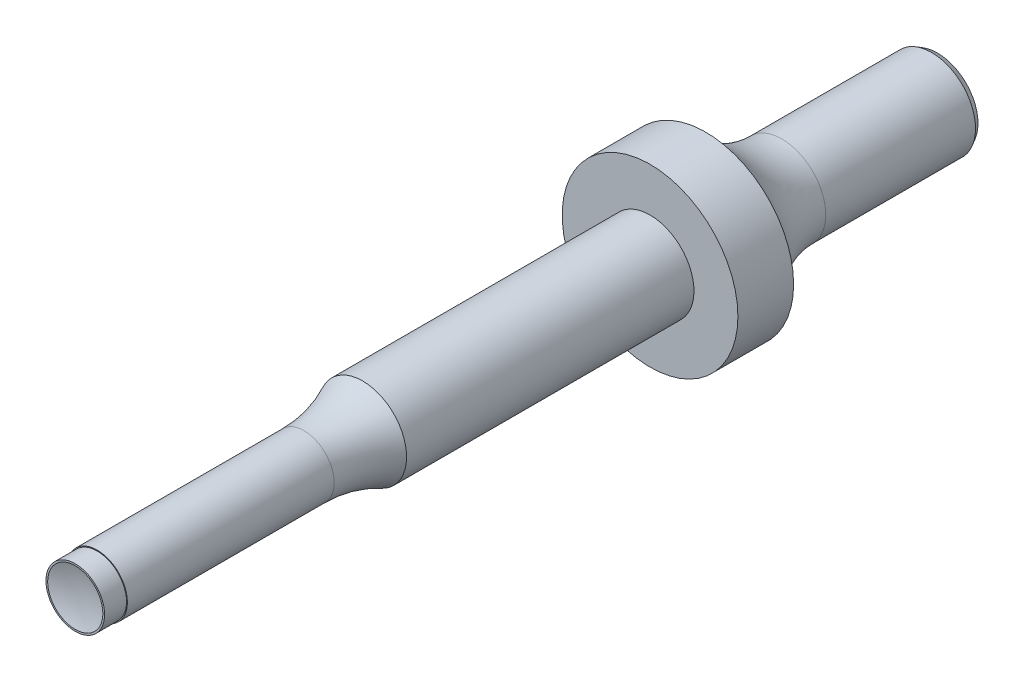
from build123d import *

# Parameters (mm, degrees)
SKETCH1_R           = 5.095
BOSS_EXTRUDE1_DEPTH = 100
SKETCH2_OUTSIDE_W   = 32.396
SKETCH2_OUTSIDE_H   = 32.396
SKETCH2_OUTSIDE_R   = 3.5
CUT_EXTRUDE1_DEPTH  = 33.333333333
SKETCH3_OUTSIDE_W   = 32.396
SKETCH3_OUTSIDE_H   = 32.396
SKETCH3_OUTSIDE_R   = 3.4
CUT_EXTRUDE2_DEPTH  = 2.5475
CHAMFER1_SIZE       = 0.679333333
CHAMFER1_SIZE2      = 0.392213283


with BuildPart() as part:
    # Sketch1 → Boss-Extrude1 (new body)
    with BuildSketch(Plane.XY):
        Circle(SKETCH1_R)
    extrude(amount=-BOSS_EXTRUDE1_DEPTH)

    # Sketch2 outside → Cut-Extrude1 (cut)
    with BuildSketch(Plane.XY):
        Rectangle(SKETCH2_OUTSIDE_W, SKETCH2_OUTSIDE_H)
        Circle(SKETCH2_OUTSIDE_R, mode=Mode.SUBTRACT)
    extrude(amount=-CUT_EXTRUDE1_DEPTH, mode=Mode.SUBTRACT)

    # Sketch3 outside → Cut-Extrude2 (cut)
    with BuildSketch(Plane.XY):
        Rectangle(SKETCH3_OUTSIDE_W, SKETCH3_OUTSIDE_H)
        Circle(SKETCH3_OUTSIDE_R, mode=Mode.SUBTRACT)
    extrude(amount=-CUT_EXTRUDE2_DEPTH, mode=Mode.SUBTRACT)

    # Sketch4 → Cut-Revolve1 (revolve, cut)
    with BuildSketch(Plane(origin=(0, 0, 0), x_dir=(0, 0, -1), z_dir=(1, 0, 0)), mode=Mode.PRIVATE) as cut_revolve1_sk:
        with BuildLine():
            Line((0, 0), (0, 3.2))
            ThreePointArc((0, 3.2), (0.385793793, 1.620627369), (0.515492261, 0))
            Line((0.515492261, 0), (0, 0))
        make_face()
    revolve(cut_revolve1_sk.sketch.rotate(Axis((0, 0, 0), (0, 0, -1)), 180), axis=Axis((0, 0, 0), (0, 0, -1)), mode=Mode.SUBTRACT)

    # Chamfer1
    chamfer1_edges = [part.edges().sort_by_distance(p)[0] for p in [
        (-5.095, 0, -100),
    ]]
    chamfer1_side = [part.faces().sort_by_distance(p)[0] for p in [
        (-5.095, 0, -66.666666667),
    ]]
    chamfer(chamfer1_edges, length=CHAMFER1_SIZE, length2=CHAMFER1_SIZE2, reference=chamfer1_side[0])

    # Sketch5 → Revolve1 (revolve)
    with BuildSketch(Plane(origin=(0, 0, 0), x_dir=(0, 0, -1), z_dir=(1, 0, 0)), mode=Mode.PRIVATE) as revolve1_sk:
        with BuildLine():
            Line((33.333333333, 0), (26.535162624, 0))
            Line((26.535162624, 0), (26.535162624, 3.5))
            ThreePointArc((26.535162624, 3.5), (30.026550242, 3.90409151), (33.333333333, 5.095))
            Line((33.333333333, 5.095), (33.333333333, 0))
        make_face()
    revolve(revolve1_sk.sketch.rotate(Axis((0, 0, -33.333333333), (0, 0, 1)), 270), axis=Axis((0, 0, -33.333333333), (0, 0, 1)))

    # Sketch6 → Revolve2 (revolve)
    with BuildSketch(Plane(origin=(0, 0, 0), x_dir=(0, 0, -1), z_dir=(1, 0, 0)), mode=Mode.PRIVATE) as revolve2_sk:
        with BuildLine():
            Line((66.666666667, 0), (81.951666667, 0))
            Line((81.951666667, 0), (81.951666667, 5.095))
            ThreePointArc((81.951666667, 5.095), (76.856666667, 6.460201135), (73.126867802, 10.19))
            Line((73.126867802, 10.19), (66.666666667, 10.19))
            Line((66.666666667, 10.19), (66.666666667, 0))
        make_face()
    revolve(revolve2_sk.sketch.rotate(Axis((0, 0, -66.666666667), (0, 0, -1)), 90), axis=Axis((0, 0, -66.666666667), (0, 0, -1)))


solid = part.part
